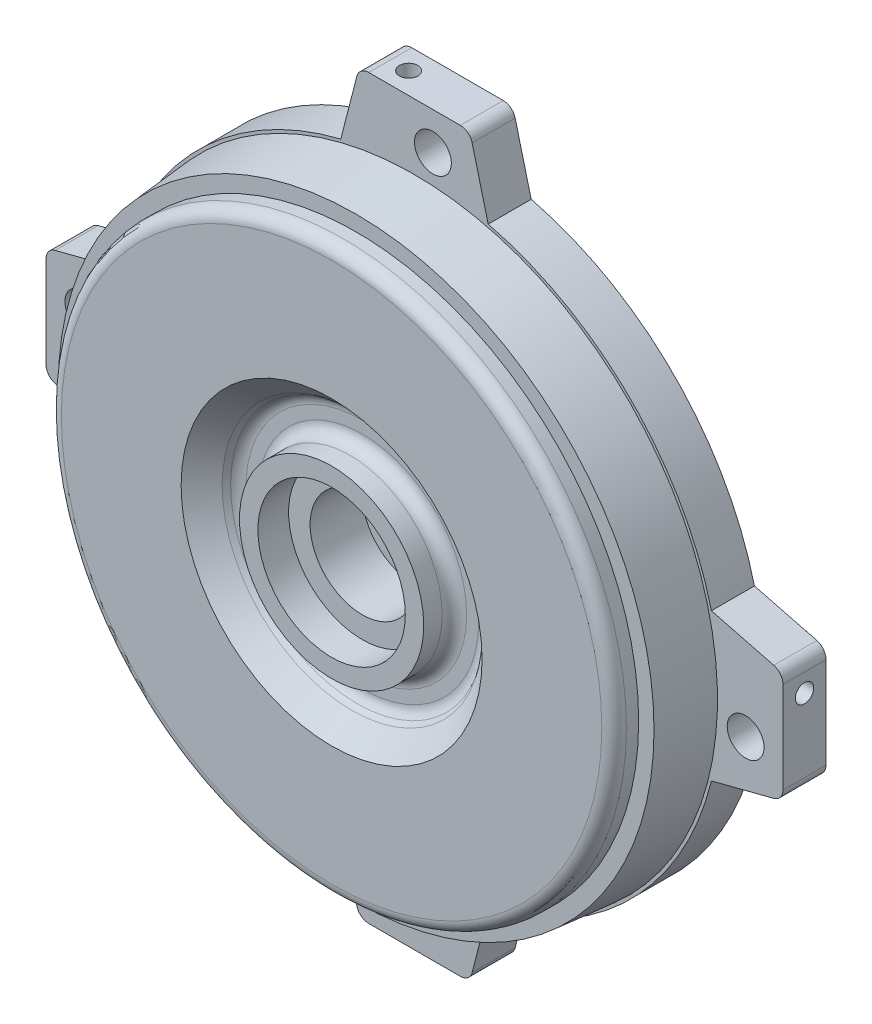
ISO-10303-21;
HEADER;
FILE_DESCRIPTION(('STEP AP214'),'2;1');
FILE_NAME('part.step','',(''),(''),'','','');
FILE_SCHEMA(('AUTOMOTIVE_DESIGN { 1 0 10303 214 1 1 1 1 }'));
ENDSEC;
DATA;
#1=APPLICATION_CONTEXT('core data for automotive mechanical design processes');
#2=APPLICATION_PROTOCOL_DEFINITION('international standard','automotive_design',2000,#1);
#3=PRODUCT_CONTEXT('',#1,'mechanical');
#4=PRODUCT('Part','Part','',(#3));
#5=PRODUCT_RELATED_PRODUCT_CATEGORY('part','',(#4));
#6=PRODUCT_DEFINITION_FORMATION('','',#4);
#7=PRODUCT_DEFINITION_CONTEXT('part definition',#1,'design');
#8=PRODUCT_DEFINITION('design','',#6,#7);
#9=PRODUCT_DEFINITION_SHAPE('','',#8);
#10=(LENGTH_UNIT() NAMED_UNIT(*) SI_UNIT(.MILLI.,.METRE.));
#11=(NAMED_UNIT(*) PLANE_ANGLE_UNIT() SI_UNIT($,.RADIAN.));
#12=(NAMED_UNIT(*) SI_UNIT($,.STERADIAN.) SOLID_ANGLE_UNIT());
#13=UNCERTAINTY_MEASURE_WITH_UNIT(LENGTH_MEASURE(1.E-05),#10,'distance_accuracy_value','');
#14=(GEOMETRIC_REPRESENTATION_CONTEXT(3) GLOBAL_UNCERTAINTY_ASSIGNED_CONTEXT((#13)) GLOBAL_UNIT_ASSIGNED_CONTEXT((#10,
#11,#12)) REPRESENTATION_CONTEXT('',''));
#15=CARTESIAN_POINT('',(0.,0.,0.));
#16=DIRECTION('',(0.,0.,1.));
#17=DIRECTION('',(1.,0.,0.));
#18=AXIS2_PLACEMENT_3D('',#15,#16,#17);
#19=CARTESIAN_POINT('',(0.,0.,-16.5));
#20=DIRECTION('',(0.,0.,1.));
#21=DIRECTION('',(1.,0.,0.));
#22=AXIS2_PLACEMENT_3D('',#19,#20,#21);
#23=CYLINDRICAL_SURFACE('',#22,8.5);
#24=CARTESIAN_POINT('',(0.,0.,-1.));
#25=DIRECTION('',(0.,0.,1.));
#26=DIRECTION('',(1.,0.,0.));
#27=AXIS2_PLACEMENT_3D('',#24,#25,#26);
#28=CIRCLE('',#27,8.5);
#29=CARTESIAN_POINT('',(8.5,0.,-1.));
#30=VERTEX_POINT('',#29);
#31=EDGE_CURVE('E561',#30,#30,#28,.T.);
#32=ORIENTED_EDGE('',*,*,#31,.T.);
#33=EDGE_LOOP('',(#32));
#34=FACE_BOUND('',#33,.T.);
#35=CARTESIAN_POINT('',(0.,0.,-9.5));
#36=DIRECTION('',(0.,0.,-1.));
#37=DIRECTION('',(-1.,0.,0.));
#38=AXIS2_PLACEMENT_3D('',#35,#36,#37);
#39=CIRCLE('',#38,8.5);
#40=CARTESIAN_POINT('',(-8.5,0.,-9.5));
#41=VERTEX_POINT('',#40);
#42=EDGE_CURVE('E254',#41,#41,#39,.F.);
#43=ORIENTED_EDGE('',*,*,#42,.F.);
#44=EDGE_LOOP('',(#43));
#45=FACE_BOUND('',#44,.T.);
#46=ADVANCED_FACE('F16',(#34,#45),#23,.F.);
#47=CARTESIAN_POINT('',(0.,0.,0.));
#48=DIRECTION('',(0.,0.,-1.));
#49=DIRECTION('',(-1.,0.,0.));
#50=AXIS2_PLACEMENT_3D('',#47,#48,#49);
#51=CONICAL_SURFACE('',#50,48.5,0.0872664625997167);
#52=CARTESIAN_POINT('',(0.,0.,0.));
#53=DIRECTION('',(0.,0.,-1.));
#54=DIRECTION('',(-1.,0.,0.));
#55=AXIS2_PLACEMENT_3D('',#52,#53,#54);
#56=CIRCLE('',#55,48.5);
#57=CARTESIAN_POINT('',(-48.5,0.,0.));
#58=VERTEX_POINT('',#57);
#59=EDGE_CURVE('E219',#58,#58,#56,.T.);
#60=ORIENTED_EDGE('',*,*,#59,.T.);
#61=EDGE_LOOP('',(#60));
#62=FACE_BOUND('',#61,.T.);
#63=CARTESIAN_POINT('',(0.,0.,-9.5));
#64=DIRECTION('',(0.,0.,-1.));
#65=DIRECTION('',(-1.,0.,0.));
#66=AXIS2_PLACEMENT_3D('',#63,#64,#65);
#67=CIRCLE('',#66,49.3311423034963);
#68=CARTESIAN_POINT('',(-49.3311423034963,0.,-9.5));
#69=VERTEX_POINT('',#68);
#70=EDGE_CURVE('E250',#69,#69,#67,.T.);
#71=ORIENTED_EDGE('',*,*,#70,.F.);
#72=EDGE_LOOP('',(#71));
#73=FACE_BOUND('',#72,.T.);
#74=ADVANCED_FACE('F387',(#62,#73),#51,.T.);
#75=CARTESIAN_POINT('',(0.,0.,-1.));
#76=DIRECTION('',(0.,0.,1.));
#77=DIRECTION('',(1.,0.,0.));
#78=AXIS2_PLACEMENT_3D('',#75,#76,#77);
#79=PLANE('',#78);
#80=CARTESIAN_POINT('',(0.,0.,-1.));
#81=DIRECTION('',(0.,0.,1.));
#82=DIRECTION('',(1.,0.,0.));
#83=AXIS2_PLACEMENT_3D('',#80,#81,#82);
#84=CIRCLE('',#83,17.);
#85=CARTESIAN_POINT('',(17.,0.,-1.));
#86=VERTEX_POINT('',#85);
#87=EDGE_CURVE('E242',#86,#86,#84,.F.);
#88=ORIENTED_EDGE('',*,*,#87,.T.);
#89=EDGE_LOOP('',(#88));
#90=FACE_BOUND('',#89,.T.);
#91=CARTESIAN_POINT('',(0.,0.,-1.));
#92=DIRECTION('',(0.,0.,1.));
#93=DIRECTION('',(1.,0.,0.));
#94=AXIS2_PLACEMENT_3D('',#91,#92,#93);
#95=CIRCLE('',#94,18.9578282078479);
#96=CARTESIAN_POINT('',(18.957828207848,0.,-1.));
#97=VERTEX_POINT('',#96);
#98=EDGE_CURVE('E238',#97,#97,#95,.T.);
#99=ORIENTED_EDGE('',*,*,#98,.T.);
#100=EDGE_LOOP('',(#99));
#101=FACE_BOUND('',#100,.T.);
#102=ADVANCED_FACE('F393',(#90,#101),#79,.T.);
#103=CARTESIAN_POINT('',(0.,0.,4.));
#104=DIRECTION('',(0.,0.,-1.));
#105=DIRECTION('',(-1.,0.,0.));
#106=AXIS2_PLACEMENT_3D('',#103,#104,#105);
#107=CYLINDRICAL_SURFACE('',#106,46.);
#108=CARTESIAN_POINT('',(0.,0.,2.));
#109=DIRECTION('',(0.,0.,1.));
#110=DIRECTION('',(1.,0.,0.));
#111=AXIS2_PLACEMENT_3D('',#108,#109,#110);
#112=CIRCLE('',#111,46.);
#113=CARTESIAN_POINT('',(46.,0.,2.));
#114=VERTEX_POINT('',#113);
#115=EDGE_CURVE('E259',#114,#114,#112,.F.);
#116=ORIENTED_EDGE('',*,*,#115,.T.);
#117=EDGE_LOOP('',(#116));
#118=FACE_BOUND('',#117,.T.);
#119=CARTESIAN_POINT('',(0.,0.,0.));
#120=DIRECTION('',(0.,0.,-1.));
#121=DIRECTION('',(-1.,0.,0.));
#122=AXIS2_PLACEMENT_3D('',#119,#120,#121);
#123=CIRCLE('',#122,46.);
#124=CARTESIAN_POINT('',(-46.,0.,0.));
#125=VERTEX_POINT('',#124);
#126=EDGE_CURVE('E230',#125,#125,#123,.T.);
#127=ORIENTED_EDGE('',*,*,#126,.F.);
#128=EDGE_LOOP('',(#127));
#129=FACE_BOUND('',#128,.T.);
#130=ADVANCED_FACE('F18',(#118,#129),#107,.T.);
#131=CARTESIAN_POINT('',(0.,0.,4.));
#132=DIRECTION('',(0.,0.,1.));
#133=DIRECTION('',(1.,0.,0.));
#134=AXIS2_PLACEMENT_3D('',#131,#132,#133);
#135=PLANE('',#134);
#136=CARTESIAN_POINT('',(0.,0.,4.));
#137=DIRECTION('',(0.,0.,1.));
#138=DIRECTION('',(1.,0.,0.));
#139=AXIS2_PLACEMENT_3D('',#136,#137,#138);
#140=CIRCLE('',#139,24.5);
#141=CARTESIAN_POINT('',(24.5,0.,4.));
#142=VERTEX_POINT('',#141);
#143=EDGE_CURVE('E11',#142,#142,#140,.F.);
#144=ORIENTED_EDGE('',*,*,#143,.T.);
#145=EDGE_LOOP('',(#144));
#146=FACE_BOUND('',#145,.T.);
#147=CARTESIAN_POINT('',(0.,0.,4.));
#148=DIRECTION('',(0.,0.,1.));
#149=DIRECTION('',(1.,0.,0.));
#150=AXIS2_PLACEMENT_3D('',#147,#148,#149);
#151=CIRCLE('',#150,44.);
#152=CARTESIAN_POINT('',(44.,0.,4.));
#153=VERTEX_POINT('',#152);
#154=EDGE_CURVE('E255',#153,#153,#151,.T.);
#155=ORIENTED_EDGE('',*,*,#154,.T.);
#156=EDGE_LOOP('',(#155));
#157=FACE_BOUND('',#156,.T.);
#158=ADVANCED_FACE('F434',(#146,#157),#135,.T.);
#159=CARTESIAN_POINT('',(0.,0.,0.));
#160=DIRECTION('',(0.,0.,-1.));
#161=DIRECTION('',(-1.,0.,0.));
#162=AXIS2_PLACEMENT_3D('',#159,#160,#161);
#163=PLANE('',#162);
#164=ORIENTED_EDGE('',*,*,#59,.F.);
#165=EDGE_LOOP('',(#164));
#166=FACE_BOUND('',#165,.T.);
#167=ORIENTED_EDGE('',*,*,#126,.T.);
#168=EDGE_LOOP('',(#167));
#169=FACE_BOUND('',#168,.T.);
#170=ADVANCED_FACE('F423',(#166,#169),#163,.F.);
#171=CARTESIAN_POINT('',(0.,0.,4.));
#172=DIRECTION('',(0.,0.,1.));
#173=DIRECTION('',(1.,0.,0.));
#174=AXIS2_PLACEMENT_3D('',#171,#172,#173);
#175=CONICAL_SURFACE('',#174,23.5,0.610865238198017);
#176=CARTESIAN_POINT('',(0.,0.,0.664359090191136));
#177=DIRECTION('',(0.,0.,1.));
#178=DIRECTION('',(1.,0.,0.));
#179=AXIS2_PLACEMENT_3D('',#176,#177,#178);
#180=CIRCLE('',#179,21.1643590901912);
#181=CARTESIAN_POINT('',(21.1643590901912,0.,0.664359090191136));
#182=VERTEX_POINT('',#181);
#183=EDGE_CURVE('E25',#182,#182,#180,.T.);
#184=ORIENTED_EDGE('',*,*,#183,.T.);
#185=EDGE_LOOP('',(#184));
#186=FACE_BOUND('',#185,.T.);
#187=CARTESIAN_POINT('',(0.,0.,-0.147152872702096));
#188=DIRECTION('',(0.,0.,-1.));
#189=DIRECTION('',(-1.,0.,0.));
#190=AXIS2_PLACEMENT_3D('',#187,#188,#189);
#191=CIRCLE('',#190,20.5961322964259);
#192=CARTESIAN_POINT('',(-20.596132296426,0.,-0.147152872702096));
#193=VERTEX_POINT('',#192);
#194=EDGE_CURVE('E246',#193,#193,#191,.T.);
#195=ORIENTED_EDGE('',*,*,#194,.T.);
#196=EDGE_LOOP('',(#195));
#197=FACE_BOUND('',#196,.T.);
#198=ADVANCED_FACE('F365',(#186,#197),#175,.F.);
#199=CARTESIAN_POINT('',(0.,0.,46.4264068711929));
#200=DIRECTION('',(0.,0.,-1.));
#201=DIRECTION('',(-1.,0.,0.));
#202=AXIS2_PLACEMENT_3D('',#199,#200,#201);
#203=CYLINDRICAL_SURFACE('',#202,15.);
#204=CARTESIAN_POINT('',(0.,0.,1.));
#205=DIRECTION('',(0.,0.,1.));
#206=DIRECTION('',(1.,0.,0.));
#207=AXIS2_PLACEMENT_3D('',#204,#205,#206);
#208=CIRCLE('',#207,15.);
#209=CARTESIAN_POINT('',(15.,0.,1.));
#210=VERTEX_POINT('',#209);
#211=EDGE_CURVE('E234',#210,#210,#208,.T.);
#212=ORIENTED_EDGE('',*,*,#211,.T.);
#213=EDGE_LOOP('',(#212));
#214=FACE_BOUND('',#213,.T.);
#215=CARTESIAN_POINT('',(0.,0.,4.));
#216=DIRECTION('',(0.,0.,1.));
#217=DIRECTION('',(1.,0.,0.));
#218=AXIS2_PLACEMENT_3D('',#215,#216,#217);
#219=CIRCLE('',#218,15.);
#220=CARTESIAN_POINT('',(15.,0.,4.));
#221=VERTEX_POINT('',#220);
#222=EDGE_CURVE('E225',#221,#221,#219,.T.);
#223=ORIENTED_EDGE('',*,*,#222,.F.);
#224=EDGE_LOOP('',(#223));
#225=FACE_BOUND('',#224,.T.);
#226=ADVANCED_FACE('F411',(#214,#225),#203,.T.);
#227=CARTESIAN_POINT('',(0.,0.,4.));
#228=DIRECTION('',(0.,0.,1.));
#229=DIRECTION('',(1.,0.,0.));
#230=AXIS2_PLACEMENT_3D('',#227,#228,#229);
#231=PLANE('',#230);
#232=CARTESIAN_POINT('',(0.,0.,4.));
#233=DIRECTION('',(0.,0.,1.));
#234=DIRECTION('',(1.,0.,0.));
#235=AXIS2_PLACEMENT_3D('',#232,#233,#234);
#236=CIRCLE('',#235,12.);
#237=CARTESIAN_POINT('',(12.,0.,4.));
#238=VERTEX_POINT('',#237);
#239=EDGE_CURVE('E555',#238,#238,#236,.T.);
#240=ORIENTED_EDGE('',*,*,#239,.F.);
#241=EDGE_LOOP('',(#240));
#242=FACE_BOUND('',#241,.T.);
#243=ORIENTED_EDGE('',*,*,#222,.T.);
#244=EDGE_LOOP('',(#243));
#245=FACE_BOUND('',#244,.T.);
#246=ADVANCED_FACE('F409',(#242,#245),#231,.T.);
#247=CARTESIAN_POINT('',(0.,0.,-1.));
#248=DIRECTION('',(0.,0.,1.));
#249=DIRECTION('',(1.,0.,0.));
#250=AXIS2_PLACEMENT_3D('',#247,#248,#249);
#251=CYLINDRICAL_SURFACE('',#250,12.);
#252=CARTESIAN_POINT('',(0.,0.,-1.));
#253=DIRECTION('',(0.,0.,1.));
#254=DIRECTION('',(1.,0.,0.));
#255=AXIS2_PLACEMENT_3D('',#252,#253,#254);
#256=CIRCLE('',#255,12.);
#257=CARTESIAN_POINT('',(12.,0.,-1.));
#258=VERTEX_POINT('',#257);
#259=EDGE_CURVE('E548',#258,#258,#256,.T.);
#260=ORIENTED_EDGE('',*,*,#259,.F.);
#261=EDGE_LOOP('',(#260));
#262=FACE_BOUND('',#261,.T.);
#263=ORIENTED_EDGE('',*,*,#239,.T.);
#264=EDGE_LOOP('',(#263));
#265=FACE_BOUND('',#264,.T.);
#266=ADVANCED_FACE('F405',(#262,#265),#251,.F.);
#267=CARTESIAN_POINT('',(0.,0.,-1.));
#268=DIRECTION('',(0.,0.,1.));
#269=DIRECTION('',(1.,0.,0.));
#270=AXIS2_PLACEMENT_3D('',#267,#268,#269);
#271=PLANE('',#270);
#272=ORIENTED_EDGE('',*,*,#31,.F.);
#273=EDGE_LOOP('',(#272));
#274=FACE_BOUND('',#273,.T.);
#275=ORIENTED_EDGE('',*,*,#259,.T.);
#276=EDGE_LOOP('',(#275));
#277=FACE_BOUND('',#276,.T.);
#278=ADVANCED_FACE('F402',(#274,#277),#271,.T.);
#279=CARTESIAN_POINT('',(0.,0.,1.));
#280=DIRECTION('',(0.,0.,1.));
#281=DIRECTION('',(1.,0.,0.));
#282=AXIS2_PLACEMENT_3D('',#279,#280,#281);
#283=TOROIDAL_SURFACE('',#282,17.,2.);
#284=ORIENTED_EDGE('',*,*,#87,.F.);
#285=EDGE_LOOP('',(#284));
#286=FACE_BOUND('',#285,.T.);
#287=ORIENTED_EDGE('',*,*,#211,.F.);
#288=EDGE_LOOP('',(#287));
#289=FACE_BOUND('',#288,.T.);
#290=ADVANCED_FACE('F400',(#286,#289),#283,.F.);
#291=CARTESIAN_POINT('',(0.,0.,1.));
#292=DIRECTION('',(0.,0.,1.));
#293=DIRECTION('',(1.,0.,0.));
#294=AXIS2_PLACEMENT_3D('',#291,#292,#293);
#295=TOROIDAL_SURFACE('',#294,18.9578282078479,2.);
#296=ORIENTED_EDGE('',*,*,#194,.F.);
#297=EDGE_LOOP('',(#296));
#298=FACE_BOUND('',#297,.T.);
#299=ORIENTED_EDGE('',*,*,#98,.F.);
#300=EDGE_LOOP('',(#299));
#301=FACE_BOUND('',#300,.T.);
#302=ADVANCED_FACE('F466',(#298,#301),#295,.F.);
#303=CARTESIAN_POINT('',(53.9166022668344,-3.,-9.49999999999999));
#304=DIRECTION('',(0.,0.,-1.));
#305=DIRECTION('',(-1.,0.,0.));
#306=AXIS2_PLACEMENT_3D('',#303,#304,#305);
#307=CYLINDRICAL_SURFACE('',#306,3.);
#308=CARTESIAN_POINT('',(53.9166022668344,-3.,-9.49999999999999));
#309=DIRECTION('',(0.,0.,-1.));
#310=DIRECTION('',(-1.,0.,0.));
#311=AXIS2_PLACEMENT_3D('',#308,#309,#310);
#312=CIRCLE('',#311,3.);
#313=CARTESIAN_POINT('',(50.9166022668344,-3.,-9.49999999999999));
#314=VERTEX_POINT('',#313);
#315=EDGE_CURVE('E703',#314,#314,#312,.T.);
#316=ORIENTED_EDGE('',*,*,#315,.F.);
#317=EDGE_LOOP('',(#316));
#318=FACE_BOUND('',#317,.T.);
#319=CARTESIAN_POINT('',(53.9166022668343,-3.,-16.5));
#320=DIRECTION('',(0.,0.,-1.));
#321=DIRECTION('',(-1.,0.,0.));
#322=AXIS2_PLACEMENT_3D('',#319,#320,#321);
#323=CIRCLE('',#322,3.);
#324=CARTESIAN_POINT('',(50.9166022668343,-3.,-16.5));
#325=VERTEX_POINT('',#324);
#326=EDGE_CURVE('E707',#325,#325,#323,.T.);
#327=ORIENTED_EDGE('',*,*,#326,.T.);
#328=EDGE_LOOP('',(#327));
#329=FACE_BOUND('',#328,.T.);
#330=ADVANCED_FACE('F462',(#318,#329),#307,.F.);
#331=CARTESIAN_POINT('',(-3.,-53.9166022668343,-9.5));
#332=DIRECTION('',(0.,0.,-1.));
#333=DIRECTION('',(-1.,0.,0.));
#334=AXIS2_PLACEMENT_3D('',#331,#332,#333);
#335=CYLINDRICAL_SURFACE('',#334,3.);
#336=CARTESIAN_POINT('',(-3.,-53.9166022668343,-9.5));
#337=DIRECTION('',(0.,0.,-1.));
#338=DIRECTION('',(-1.,0.,0.));
#339=AXIS2_PLACEMENT_3D('',#336,#337,#338);
#340=CIRCLE('',#339,3.);
#341=CARTESIAN_POINT('',(-6.,-53.9166022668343,-9.5));
#342=VERTEX_POINT('',#341);
#343=EDGE_CURVE('E695',#342,#342,#340,.T.);
#344=ORIENTED_EDGE('',*,*,#343,.F.);
#345=EDGE_LOOP('',(#344));
#346=FACE_BOUND('',#345,.T.);
#347=CARTESIAN_POINT('',(-3.,-53.9166022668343,-16.5));
#348=DIRECTION('',(0.,0.,-1.));
#349=DIRECTION('',(-1.,0.,0.));
#350=AXIS2_PLACEMENT_3D('',#347,#348,#349);
#351=CIRCLE('',#350,3.);
#352=CARTESIAN_POINT('',(-6.,-53.9166022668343,-16.5));
#353=VERTEX_POINT('',#352);
#354=EDGE_CURVE('E699',#353,#353,#351,.T.);
#355=ORIENTED_EDGE('',*,*,#354,.T.);
#356=EDGE_LOOP('',(#355));
#357=FACE_BOUND('',#356,.T.);
#358=ADVANCED_FACE('F465',(#346,#357),#335,.F.);
#359=CARTESIAN_POINT('',(-53.9166022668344,3.00000000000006,-9.5));
#360=DIRECTION('',(0.,0.,-1.));
#361=DIRECTION('',(-1.,0.,0.));
#362=AXIS2_PLACEMENT_3D('',#359,#360,#361);
#363=CYLINDRICAL_SURFACE('',#362,3.);
#364=CARTESIAN_POINT('',(-53.9166022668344,3.00000000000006,-9.5));
#365=DIRECTION('',(0.,0.,-1.));
#366=DIRECTION('',(-1.,0.,0.));
#367=AXIS2_PLACEMENT_3D('',#364,#365,#366);
#368=CIRCLE('',#367,3.);
#369=CARTESIAN_POINT('',(-56.9166022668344,3.00000000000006,-9.5));
#370=VERTEX_POINT('',#369);
#371=EDGE_CURVE('E687',#370,#370,#368,.T.);
#372=ORIENTED_EDGE('',*,*,#371,.F.);
#373=EDGE_LOOP('',(#372));
#374=FACE_BOUND('',#373,.T.);
#375=CARTESIAN_POINT('',(-53.9166022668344,3.00000000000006,-16.5));
#376=DIRECTION('',(0.,0.,-1.));
#377=DIRECTION('',(-1.,0.,0.));
#378=AXIS2_PLACEMENT_3D('',#375,#376,#377);
#379=CIRCLE('',#378,3.);
#380=CARTESIAN_POINT('',(-56.9166022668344,3.00000000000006,-16.5));
#381=VERTEX_POINT('',#380);
#382=EDGE_CURVE('E691',#381,#381,#379,.T.);
#383=ORIENTED_EDGE('',*,*,#382,.T.);
#384=EDGE_LOOP('',(#383));
#385=FACE_BOUND('',#384,.T.);
#386=ADVANCED_FACE('F470',(#374,#385),#363,.F.);
#387=CARTESIAN_POINT('',(3.,53.9166022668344,-9.5));
#388=DIRECTION('',(0.,0.,-1.));
#389=DIRECTION('',(-1.,0.,0.));
#390=AXIS2_PLACEMENT_3D('',#387,#388,#389);
#391=CYLINDRICAL_SURFACE('',#390,3.);
#392=CARTESIAN_POINT('',(3.,53.9166022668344,-9.5));
#393=DIRECTION('',(0.,0.,-1.));
#394=DIRECTION('',(-1.,0.,0.));
#395=AXIS2_PLACEMENT_3D('',#392,#393,#394);
#396=CIRCLE('',#395,3.);
#397=CARTESIAN_POINT('',(0.,53.9166022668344,-9.5));
#398=VERTEX_POINT('',#397);
#399=EDGE_CURVE('E202',#398,#398,#396,.T.);
#400=ORIENTED_EDGE('',*,*,#399,.F.);
#401=EDGE_LOOP('',(#400));
#402=FACE_BOUND('',#401,.T.);
#403=CARTESIAN_POINT('',(3.,53.9166022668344,-16.5));
#404=DIRECTION('',(0.,0.,-1.));
#405=DIRECTION('',(-1.,0.,0.));
#406=AXIS2_PLACEMENT_3D('',#403,#404,#405);
#407=CIRCLE('',#406,3.);
#408=CARTESIAN_POINT('',(0.,53.9166022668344,-16.5));
#409=VERTEX_POINT('',#408);
#410=EDGE_CURVE('E684',#409,#409,#407,.T.);
#411=ORIENTED_EDGE('',*,*,#410,.T.);
#412=EDGE_LOOP('',(#411));
#413=FACE_BOUND('',#412,.T.);
#414=ADVANCED_FACE('F474',(#402,#413),#391,.F.);
#415=CARTESIAN_POINT('',(48.3453018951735,12.0000000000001,-9.5));
#416=DIRECTION('',(0.249280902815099,0.968431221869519,0.));
#417=DIRECTION('',(-0.968431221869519,0.249280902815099,0.));
#418=AXIS2_PLACEMENT_3D('',#415,#416,#417);
#419=PLANE('',#418);
#420=DIRECTION('',(0.968431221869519,-0.249280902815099,0.));
#421=VECTOR('',#420,1.);
#422=CARTESIAN_POINT('',(48.3453018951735,12.0000000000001,-9.5));
#423=LINE('',#422,#421);
#424=CARTESIAN_POINT('',(48.3453018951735,12.0000000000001,-9.5));
#425=VERTEX_POINT('',#424);
#426=CARTESIAN_POINT('',(58.4985618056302,9.38648058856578,-9.5));
#427=VERTEX_POINT('',#426);
#428=EDGE_CURVE('E641',#425,#427,#423,.T.);
#429=ORIENTED_EDGE('',*,*,#428,.T.);
#430=DIRECTION('',(0.,0.,-1.));
#431=VECTOR('',#430,1.);
#432=CARTESIAN_POINT('',(58.4985618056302,9.38648058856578,-9.5));
#433=LINE('',#432,#431);
#434=CARTESIAN_POINT('',(58.4985618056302,9.38648058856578,-16.5));
#435=VERTEX_POINT('',#434);
#436=EDGE_CURVE('E198',#427,#435,#433,.T.);
#437=ORIENTED_EDGE('',*,*,#436,.T.);
#438=DIRECTION('',(0.968431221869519,-0.249280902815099,0.));
#439=VECTOR('',#438,1.);
#440=CARTESIAN_POINT('',(48.3453018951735,12.0000000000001,-16.5));
#441=LINE('',#440,#439);
#442=CARTESIAN_POINT('',(48.3453018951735,12.0000000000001,-16.5));
#443=VERTEX_POINT('',#442);
#444=EDGE_CURVE('E195',#443,#435,#441,.T.);
#445=ORIENTED_EDGE('',*,*,#444,.F.);
#446=DIRECTION('',(0.,0.,-1.));
#447=VECTOR('',#446,1.);
#448=CARTESIAN_POINT('',(48.3453018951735,12.0000000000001,-9.5));
#449=LINE('',#448,#447);
#450=EDGE_CURVE('E180',#425,#443,#449,.T.);
#451=ORIENTED_EDGE('',*,*,#450,.F.);
#452=EDGE_LOOP('',(#429,#437,#445,#451));
#453=FACE_BOUND('',#452,.T.);
#454=ADVANCED_FACE('F196',(#453),#419,.T.);
#455=CARTESIAN_POINT('',(60.0000000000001,9.00000000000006,-9.5));
#456=DIRECTION('',(1.,0.,0.));
#457=DIRECTION('',(0.,0.,-1.));
#458=AXIS2_PLACEMENT_3D('',#455,#456,#457);
#459=PLANE('',#458);
#460=CARTESIAN_POINT('',(60.0000000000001,4.44961814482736,-13.));
#461=DIRECTION('',(1.,0.,0.));
#462=DIRECTION('',(0.,0.,1.));
#463=AXIS2_PLACEMENT_3D('',#460,#461,#462);
#464=CIRCLE('',#463,1.5);
#465=CARTESIAN_POINT('',(60.0000000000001,4.44961814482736,-11.5));
#466=VERTEX_POINT('',#465);
#467=EDGE_CURVE('E747',#466,#466,#464,.T.);
#468=ORIENTED_EDGE('',*,*,#467,.F.);
#469=EDGE_LOOP('',(#468));
#470=FACE_BOUND('',#469,.T.);
#471=DIRECTION('',(0.,-1.,0.));
#472=VECTOR('',#471,1.);
#473=CARTESIAN_POINT('',(60.0000000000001,9.00000000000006,-16.5));
#474=LINE('',#473,#472);
#475=CARTESIAN_POINT('',(60.0000000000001,7.44961814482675,-16.5));
#476=VERTEX_POINT('',#475);
#477=CARTESIAN_POINT('',(60.0000000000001,-7.4496181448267,-16.5));
#478=VERTEX_POINT('',#477);
#479=EDGE_CURVE('E201',#476,#478,#474,.T.);
#480=ORIENTED_EDGE('',*,*,#479,.F.);
#481=DIRECTION('',(0.,0.,-1.));
#482=VECTOR('',#481,1.);
#483=CARTESIAN_POINT('',(60.0000000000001,7.44961814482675,-9.5));
#484=LINE('',#483,#482);
#485=CARTESIAN_POINT('',(60.0000000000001,7.44961814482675,-9.5));
#486=VERTEX_POINT('',#485);
#487=EDGE_CURVE('E327',#476,#486,#484,.F.);
#488=ORIENTED_EDGE('',*,*,#487,.T.);
#489=DIRECTION('',(0.,-1.,0.));
#490=VECTOR('',#489,1.);
#491=CARTESIAN_POINT('',(60.0000000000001,9.00000000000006,-9.5));
#492=LINE('',#491,#490);
#493=CARTESIAN_POINT('',(60.0000000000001,-7.4496181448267,-9.5));
#494=VERTEX_POINT('',#493);
#495=EDGE_CURVE('E638',#486,#494,#492,.T.);
#496=ORIENTED_EDGE('',*,*,#495,.T.);
#497=DIRECTION('',(0.,0.,-1.));
#498=VECTOR('',#497,1.);
#499=CARTESIAN_POINT('',(60.0000000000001,-7.4496181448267,-9.5));
#500=LINE('',#499,#498);
#501=EDGE_CURVE('E323',#494,#478,#500,.T.);
#502=ORIENTED_EDGE('',*,*,#501,.T.);
#503=EDGE_LOOP('',(#480,#488,#496,#502));
#504=FACE_BOUND('',#503,.T.);
#505=ADVANCED_FACE('F522',(#470,#504),#459,.T.);
#506=CARTESIAN_POINT('',(60.0000000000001,-9.00000000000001,-9.5));
#507=DIRECTION('',(0.249280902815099,-0.968431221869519,0.));
#508=DIRECTION('',(0.968431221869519,0.249280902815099,0.));
#509=AXIS2_PLACEMENT_3D('',#506,#507,#508);
#510=PLANE('',#509);
#511=DIRECTION('',(-0.968431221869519,-0.249280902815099,0.));
#512=VECTOR('',#511,1.);
#513=CARTESIAN_POINT('',(60.0000000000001,-9.00000000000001,-16.5));
#514=LINE('',#513,#512);
#515=CARTESIAN_POINT('',(58.4985618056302,-9.38648058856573,-16.5));
#516=VERTEX_POINT('',#515);
#517=CARTESIAN_POINT('',(48.3453018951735,-12.,-16.5));
#518=VERTEX_POINT('',#517);
#519=EDGE_CURVE('E675',#516,#518,#514,.T.);
#520=ORIENTED_EDGE('',*,*,#519,.F.);
#521=DIRECTION('',(0.,0.,-1.));
#522=VECTOR('',#521,1.);
#523=CARTESIAN_POINT('',(58.4985618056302,-9.38648058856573,-9.5));
#524=LINE('',#523,#522);
#525=CARTESIAN_POINT('',(58.4985618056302,-9.38648058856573,-9.5));
#526=VERTEX_POINT('',#525);
#527=EDGE_CURVE('E330',#516,#526,#524,.F.);
#528=ORIENTED_EDGE('',*,*,#527,.T.);
#529=DIRECTION('',(-0.968431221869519,-0.249280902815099,0.));
#530=VECTOR('',#529,1.);
#531=CARTESIAN_POINT('',(60.0000000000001,-9.00000000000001,-9.5));
#532=LINE('',#531,#530);
#533=CARTESIAN_POINT('',(48.3453018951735,-12.,-9.5));
#534=VERTEX_POINT('',#533);
#535=EDGE_CURVE('E635',#526,#534,#532,.T.);
#536=ORIENTED_EDGE('',*,*,#535,.T.);
#537=DIRECTION('',(0.,0.,-1.));
#538=VECTOR('',#537,1.);
#539=CARTESIAN_POINT('',(48.3453018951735,-12.,-9.5));
#540=LINE('',#539,#538);
#541=EDGE_CURVE('E190',#534,#518,#540,.T.);
#542=ORIENTED_EDGE('',*,*,#541,.T.);
#543=EDGE_LOOP('',(#520,#528,#536,#542));
#544=FACE_BOUND('',#543,.T.);
#545=ADVANCED_FACE('F518',(#544),#510,.T.);
#546=CARTESIAN_POINT('',(9.00000000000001,-60.,-9.5));
#547=DIRECTION('',(0.968431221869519,-0.249280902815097,0.));
#548=DIRECTION('',(0.249280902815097,0.968431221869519,0.));
#549=AXIS2_PLACEMENT_3D('',#546,#547,#548);
#550=PLANE('',#549);
#551=DIRECTION('',(-0.249280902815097,-0.968431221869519,0.));
#552=VECTOR('',#551,1.);
#553=CARTESIAN_POINT('',(9.00000000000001,-60.,-9.5));
#554=LINE('',#553,#552);
#555=CARTESIAN_POINT('',(12.,-48.3453018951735,-9.5));
#556=VERTEX_POINT('',#555);
#557=CARTESIAN_POINT('',(9.38648058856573,-58.4985618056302,-9.5));
#558=VERTEX_POINT('',#557);
#559=EDGE_CURVE('E627',#556,#558,#554,.T.);
#560=ORIENTED_EDGE('',*,*,#559,.T.);
#561=DIRECTION('',(0.,0.,-1.));
#562=VECTOR('',#561,1.);
#563=CARTESIAN_POINT('',(9.38648058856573,-58.4985618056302,-9.5));
#564=LINE('',#563,#562);
#565=CARTESIAN_POINT('',(9.38648058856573,-58.4985618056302,-16.5));
#566=VERTEX_POINT('',#565);
#567=EDGE_CURVE('E333',#558,#566,#564,.T.);
#568=ORIENTED_EDGE('',*,*,#567,.T.);
#569=DIRECTION('',(-0.249280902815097,-0.968431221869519,0.));
#570=VECTOR('',#569,1.);
#571=CARTESIAN_POINT('',(9.00000000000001,-60.,-16.5));
#572=LINE('',#571,#570);
#573=CARTESIAN_POINT('',(12.,-48.3453018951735,-16.5));
#574=VERTEX_POINT('',#573);
#575=EDGE_CURVE('E672',#574,#566,#572,.T.);
#576=ORIENTED_EDGE('',*,*,#575,.F.);
#577=DIRECTION('',(0.,0.,-1.));
#578=VECTOR('',#577,1.);
#579=CARTESIAN_POINT('',(12.,-48.3453018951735,-9.5));
#580=LINE('',#579,#578);
#581=EDGE_CURVE('E573',#556,#574,#580,.T.);
#582=ORIENTED_EDGE('',*,*,#581,.F.);
#583=EDGE_LOOP('',(#560,#568,#576,#582));
#584=FACE_BOUND('',#583,.T.);
#585=ADVANCED_FACE('F514',(#584),#550,.T.);
#586=CARTESIAN_POINT('',(-9.00000000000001,-60.,-9.5));
#587=DIRECTION('',(0.,-1.,0.));
#588=DIRECTION('',(0.,0.,-1.));
#589=AXIS2_PLACEMENT_3D('',#586,#587,#588);
#590=PLANE('',#589);
#591=CARTESIAN_POINT('',(4.44961814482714,-60.,-13.));
#592=DIRECTION('',(0.,-1.,0.));
#593=DIRECTION('',(0.,0.,1.));
#594=AXIS2_PLACEMENT_3D('',#591,#592,#593);
#595=CIRCLE('',#594,1.5);
#596=CARTESIAN_POINT('',(4.44961814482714,-60.,-11.5));
#597=VERTEX_POINT('',#596);
#598=EDGE_CURVE('E739',#597,#597,#595,.T.);
#599=ORIENTED_EDGE('',*,*,#598,.F.);
#600=EDGE_LOOP('',(#599));
#601=FACE_BOUND('',#600,.T.);
#602=DIRECTION('',(-1.,0.,0.));
#603=VECTOR('',#602,1.);
#604=CARTESIAN_POINT('',(-9.00000000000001,-60.,-16.5));
#605=LINE('',#604,#603);
#606=CARTESIAN_POINT('',(7.4496181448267,-60.,-16.5));
#607=VERTEX_POINT('',#606);
#608=CARTESIAN_POINT('',(-7.4496181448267,-60.,-16.5));
#609=VERTEX_POINT('',#608);
#610=EDGE_CURVE('E668',#607,#609,#605,.T.);
#611=ORIENTED_EDGE('',*,*,#610,.F.);
#612=DIRECTION('',(0.,0.,-1.));
#613=VECTOR('',#612,1.);
#614=CARTESIAN_POINT('',(7.4496181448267,-60.,-9.5));
#615=LINE('',#614,#613);
#616=CARTESIAN_POINT('',(7.4496181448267,-60.,-9.5));
#617=VERTEX_POINT('',#616);
#618=EDGE_CURVE('E341',#607,#617,#615,.F.);
#619=ORIENTED_EDGE('',*,*,#618,.T.);
#620=DIRECTION('',(-1.,0.,0.));
#621=VECTOR('',#620,1.);
#622=CARTESIAN_POINT('',(-9.00000000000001,-60.,-9.5));
#623=LINE('',#622,#621);
#624=CARTESIAN_POINT('',(-7.4496181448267,-60.,-9.5));
#625=VERTEX_POINT('',#624);
#626=EDGE_CURVE('E623',#617,#625,#623,.T.);
#627=ORIENTED_EDGE('',*,*,#626,.T.);
#628=DIRECTION('',(0.,0.,-1.));
#629=VECTOR('',#628,1.);
#630=CARTESIAN_POINT('',(-7.4496181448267,-60.,-9.5));
#631=LINE('',#630,#629);
#632=EDGE_CURVE('E337',#625,#609,#631,.T.);
#633=ORIENTED_EDGE('',*,*,#632,.T.);
#634=EDGE_LOOP('',(#611,#619,#627,#633));
#635=FACE_BOUND('',#634,.T.);
#636=ADVANCED_FACE('F510',(#601,#635),#590,.T.);
#637=CARTESIAN_POINT('',(-12.,-48.3453018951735,-9.5));
#638=DIRECTION('',(-0.968431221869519,-0.249280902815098,0.));
#639=DIRECTION('',(0.249280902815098,-0.968431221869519,0.));
#640=AXIS2_PLACEMENT_3D('',#637,#638,#639);
#641=PLANE('',#640);
#642=DIRECTION('',(-0.249280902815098,0.968431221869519,0.));
#643=VECTOR('',#642,1.);
#644=CARTESIAN_POINT('',(-12.,-48.3453018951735,-16.5));
#645=LINE('',#644,#643);
#646=CARTESIAN_POINT('',(-9.38648058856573,-58.4985618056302,-16.5));
#647=VERTEX_POINT('',#646);
#648=CARTESIAN_POINT('',(-12.,-48.3453018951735,-16.5));
#649=VERTEX_POINT('',#648);
#650=EDGE_CURVE('E665',#647,#649,#645,.T.);
#651=ORIENTED_EDGE('',*,*,#650,.F.);
#652=DIRECTION('',(0.,0.,-1.));
#653=VECTOR('',#652,1.);
#654=CARTESIAN_POINT('',(-9.38648058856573,-58.4985618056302,-9.5));
#655=LINE('',#654,#653);
#656=CARTESIAN_POINT('',(-9.38648058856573,-58.4985618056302,-9.5));
#657=VERTEX_POINT('',#656);
#658=EDGE_CURVE('E358',#647,#657,#655,.F.);
#659=ORIENTED_EDGE('',*,*,#658,.T.);
#660=DIRECTION('',(-0.249280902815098,0.968431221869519,0.));
#661=VECTOR('',#660,1.);
#662=CARTESIAN_POINT('',(-12.,-48.3453018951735,-9.5));
#663=LINE('',#662,#661);
#664=CARTESIAN_POINT('',(-12.,-48.3453018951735,-9.5));
#665=VERTEX_POINT('',#664);
#666=EDGE_CURVE('E620',#657,#665,#663,.T.);
#667=ORIENTED_EDGE('',*,*,#666,.T.);
#668=DIRECTION('',(0.,0.,-1.));
#669=VECTOR('',#668,1.);
#670=CARTESIAN_POINT('',(-12.,-48.3453018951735,-9.5));
#671=LINE('',#670,#669);
#672=EDGE_CURVE('E576',#665,#649,#671,.T.);
#673=ORIENTED_EDGE('',*,*,#672,.T.);
#674=EDGE_LOOP('',(#651,#659,#667,#673));
#675=FACE_BOUND('',#674,.T.);
#676=ADVANCED_FACE('F506',(#675),#641,.T.);
#677=CARTESIAN_POINT('',(-60.0000000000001,-9.00000000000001,-9.5));
#678=DIRECTION('',(-0.249280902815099,-0.968431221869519,0.));
#679=DIRECTION('',(0.968431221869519,-0.249280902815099,0.));
#680=AXIS2_PLACEMENT_3D('',#677,#678,#679);
#681=PLANE('',#680);
#682=DIRECTION('',(-0.968431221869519,0.249280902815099,0.));
#683=VECTOR('',#682,1.);
#684=CARTESIAN_POINT('',(-60.0000000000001,-9.00000000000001,-9.5));
#685=LINE('',#684,#683);
#686=CARTESIAN_POINT('',(-48.3453018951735,-12.,-9.5));
#687=VERTEX_POINT('',#686);
#688=CARTESIAN_POINT('',(-58.4985618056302,-9.38648058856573,-9.5));
#689=VERTEX_POINT('',#688);
#690=EDGE_CURVE('E613',#687,#689,#685,.T.);
#691=ORIENTED_EDGE('',*,*,#690,.T.);
#692=DIRECTION('',(0.,0.,-1.));
#693=VECTOR('',#692,1.);
#694=CARTESIAN_POINT('',(-58.4985618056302,-9.38648058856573,-9.5));
#695=LINE('',#694,#693);
#696=CARTESIAN_POINT('',(-58.4985618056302,-9.38648058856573,-16.5));
#697=VERTEX_POINT('',#696);
#698=EDGE_CURVE('E354',#689,#697,#695,.T.);
#699=ORIENTED_EDGE('',*,*,#698,.T.);
#700=DIRECTION('',(-0.968431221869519,0.249280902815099,0.));
#701=VECTOR('',#700,1.);
#702=CARTESIAN_POINT('',(-60.0000000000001,-9.00000000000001,-16.5));
#703=LINE('',#702,#701);
#704=CARTESIAN_POINT('',(-48.3453018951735,-12.,-16.5));
#705=VERTEX_POINT('',#704);
#706=EDGE_CURVE('E661',#705,#697,#703,.T.);
#707=ORIENTED_EDGE('',*,*,#706,.F.);
#708=DIRECTION('',(0.,0.,-1.));
#709=VECTOR('',#708,1.);
#710=CARTESIAN_POINT('',(-48.3453018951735,-12.,-9.5));
#711=LINE('',#710,#709);
#712=EDGE_CURVE('E580',#687,#705,#711,.T.);
#713=ORIENTED_EDGE('',*,*,#712,.F.);
#714=EDGE_LOOP('',(#691,#699,#707,#713));
#715=FACE_BOUND('',#714,.T.);
#716=ADVANCED_FACE('F502',(#715),#681,.T.);
#717=CARTESIAN_POINT('',(-60.0000000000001,9.00000000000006,-9.5));
#718=DIRECTION('',(-1.,0.,0.));
#719=DIRECTION('',(0.,0.,1.));
#720=AXIS2_PLACEMENT_3D('',#717,#718,#719);
#721=PLANE('',#720);
#722=CARTESIAN_POINT('',(-60.0000000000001,-4.44961814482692,-13.));
#723=DIRECTION('',(-1.,0.,0.));
#724=DIRECTION('',(0.,0.,1.));
#725=AXIS2_PLACEMENT_3D('',#722,#723,#724);
#726=CIRCLE('',#725,1.5);
#727=CARTESIAN_POINT('',(-60.0000000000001,-4.44961814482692,-11.5));
#728=VERTEX_POINT('',#727);
#729=EDGE_CURVE('E731',#728,#728,#726,.T.);
#730=ORIENTED_EDGE('',*,*,#729,.F.);
#731=EDGE_LOOP('',(#730));
#732=FACE_BOUND('',#731,.T.);
#733=DIRECTION('',(0.,1.,0.));
#734=VECTOR('',#733,1.);
#735=CARTESIAN_POINT('',(-60.0000000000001,9.00000000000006,-9.5));
#736=LINE('',#735,#734);
#737=CARTESIAN_POINT('',(-60.0000000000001,-7.4496181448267,-9.5));
#738=VERTEX_POINT('',#737);
#739=CARTESIAN_POINT('',(-60.0000000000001,7.44961814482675,-9.5));
#740=VERTEX_POINT('',#739);
#741=EDGE_CURVE('E609',#738,#740,#736,.T.);
#742=ORIENTED_EDGE('',*,*,#741,.T.);
#743=DIRECTION('',(0.,0.,-1.));
#744=VECTOR('',#743,1.);
#745=CARTESIAN_POINT('',(-60.0000000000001,7.44961814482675,-9.5));
#746=LINE('',#745,#744);
#747=CARTESIAN_POINT('',(-60.0000000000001,7.44961814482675,-16.5));
#748=VERTEX_POINT('',#747);
#749=EDGE_CURVE('E347',#740,#748,#746,.T.);
#750=ORIENTED_EDGE('',*,*,#749,.T.);
#751=DIRECTION('',(0.,1.,0.));
#752=VECTOR('',#751,1.);
#753=CARTESIAN_POINT('',(-60.0000000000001,9.00000000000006,-16.5));
#754=LINE('',#753,#752);
#755=CARTESIAN_POINT('',(-60.0000000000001,-7.4496181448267,-16.5));
#756=VERTEX_POINT('',#755);
#757=EDGE_CURVE('E657',#756,#748,#754,.T.);
#758=ORIENTED_EDGE('',*,*,#757,.F.);
#759=DIRECTION('',(0.,0.,-1.));
#760=VECTOR('',#759,1.);
#761=CARTESIAN_POINT('',(-60.0000000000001,-7.4496181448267,-9.5));
#762=LINE('',#761,#760);
#763=EDGE_CURVE('E344',#756,#738,#762,.F.);
#764=ORIENTED_EDGE('',*,*,#763,.T.);
#765=EDGE_LOOP('',(#742,#750,#758,#764));
#766=FACE_BOUND('',#765,.T.);
#767=ADVANCED_FACE('F498',(#732,#766),#721,.T.);
#768=CARTESIAN_POINT('',(-48.3453018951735,12.0000000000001,-9.5));
#769=DIRECTION('',(-0.249280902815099,0.968431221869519,0.));
#770=DIRECTION('',(-0.968431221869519,-0.249280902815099,0.));
#771=AXIS2_PLACEMENT_3D('',#768,#769,#770);
#772=PLANE('',#771);
#773=DIRECTION('',(0.968431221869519,0.249280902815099,0.));
#774=VECTOR('',#773,1.);
#775=CARTESIAN_POINT('',(-48.3453018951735,12.0000000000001,-16.5));
#776=LINE('',#775,#774);
#777=CARTESIAN_POINT('',(-58.4985618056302,9.38648058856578,-16.5));
#778=VERTEX_POINT('',#777);
#779=CARTESIAN_POINT('',(-48.3453018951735,12.0000000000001,-16.5));
#780=VERTEX_POINT('',#779);
#781=EDGE_CURVE('E654',#778,#780,#776,.T.);
#782=ORIENTED_EDGE('',*,*,#781,.F.);
#783=DIRECTION('',(0.,0.,-1.));
#784=VECTOR('',#783,1.);
#785=CARTESIAN_POINT('',(-58.4985618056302,9.38648058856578,-9.5));
#786=LINE('',#785,#784);
#787=CARTESIAN_POINT('',(-58.4985618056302,9.38648058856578,-9.5));
#788=VERTEX_POINT('',#787);
#789=EDGE_CURVE('E351',#778,#788,#786,.F.);
#790=ORIENTED_EDGE('',*,*,#789,.T.);
#791=DIRECTION('',(0.968431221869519,0.249280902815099,0.));
#792=VECTOR('',#791,1.);
#793=CARTESIAN_POINT('',(-48.3453018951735,12.0000000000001,-9.5));
#794=LINE('',#793,#792);
#795=CARTESIAN_POINT('',(-48.3453018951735,12.0000000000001,-9.5));
#796=VERTEX_POINT('',#795);
#797=EDGE_CURVE('E606',#788,#796,#794,.T.);
#798=ORIENTED_EDGE('',*,*,#797,.T.);
#799=DIRECTION('',(0.,0.,-1.));
#800=VECTOR('',#799,1.);
#801=CARTESIAN_POINT('',(-48.3453018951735,12.0000000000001,-9.5));
#802=LINE('',#801,#800);
#803=EDGE_CURVE('E583',#796,#780,#802,.T.);
#804=ORIENTED_EDGE('',*,*,#803,.T.);
#805=EDGE_LOOP('',(#782,#790,#798,#804));
#806=FACE_BOUND('',#805,.T.);
#807=ADVANCED_FACE('F494',(#806),#772,.T.);
#808=CARTESIAN_POINT('',(-9.00000000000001,60.0000000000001,-9.5));
#809=DIRECTION('',(-0.968431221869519,0.249280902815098,0.));
#810=DIRECTION('',(-0.249280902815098,-0.968431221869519,0.));
#811=AXIS2_PLACEMENT_3D('',#808,#809,#810);
#812=PLANE('',#811);
#813=DIRECTION('',(0.249280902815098,0.968431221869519,0.));
#814=VECTOR('',#813,1.);
#815=CARTESIAN_POINT('',(-9.00000000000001,60.0000000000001,-9.5));
#816=LINE('',#815,#814);
#817=CARTESIAN_POINT('',(-12.,48.3453018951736,-9.5));
#818=VERTEX_POINT('',#817);
#819=CARTESIAN_POINT('',(-9.38648058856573,58.4985618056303,-9.5));
#820=VERTEX_POINT('',#819);
#821=EDGE_CURVE('E598',#818,#820,#816,.T.);
#822=ORIENTED_EDGE('',*,*,#821,.T.);
#823=DIRECTION('',(0.,0.,-1.));
#824=VECTOR('',#823,1.);
#825=CARTESIAN_POINT('',(-9.38648058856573,58.4985618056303,-9.5));
#826=LINE('',#825,#824);
#827=CARTESIAN_POINT('',(-9.38648058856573,58.4985618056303,-16.5));
#828=VERTEX_POINT('',#827);
#829=EDGE_CURVE('E317',#820,#828,#826,.T.);
#830=ORIENTED_EDGE('',*,*,#829,.T.);
#831=DIRECTION('',(0.249280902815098,0.968431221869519,0.));
#832=VECTOR('',#831,1.);
#833=CARTESIAN_POINT('',(-9.00000000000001,60.0000000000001,-16.5));
#834=LINE('',#833,#832);
#835=CARTESIAN_POINT('',(-12.,48.3453018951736,-16.5));
#836=VERTEX_POINT('',#835);
#837=EDGE_CURVE('E650',#836,#828,#834,.T.);
#838=ORIENTED_EDGE('',*,*,#837,.F.);
#839=DIRECTION('',(0.,0.,-1.));
#840=VECTOR('',#839,1.);
#841=CARTESIAN_POINT('',(-12.,48.3453018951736,-9.5));
#842=LINE('',#841,#840);
#843=EDGE_CURVE('E587',#818,#836,#842,.T.);
#844=ORIENTED_EDGE('',*,*,#843,.F.);
#845=EDGE_LOOP('',(#822,#830,#838,#844));
#846=FACE_BOUND('',#845,.T.);
#847=ADVANCED_FACE('F490',(#846),#812,.T.);
#848=CARTESIAN_POINT('',(9.00000000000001,60.0000000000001,-9.5));
#849=DIRECTION('',(0.,1.,0.));
#850=DIRECTION('',(0.,0.,1.));
#851=AXIS2_PLACEMENT_3D('',#848,#849,#850);
#852=PLANE('',#851);
#853=CARTESIAN_POINT('',(-4.44961814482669,60.0000000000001,-13.));
#854=DIRECTION('',(0.,1.,0.));
#855=DIRECTION('',(0.,0.,1.));
#856=AXIS2_PLACEMENT_3D('',#853,#854,#855);
#857=CIRCLE('',#856,1.5);
#858=CARTESIAN_POINT('',(-4.44961814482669,60.0000000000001,-11.5));
#859=VERTEX_POINT('',#858);
#860=EDGE_CURVE('E723',#859,#859,#857,.T.);
#861=ORIENTED_EDGE('',*,*,#860,.F.);
#862=EDGE_LOOP('',(#861));
#863=FACE_BOUND('',#862,.T.);
#864=DIRECTION('',(1.,0.,0.));
#865=VECTOR('',#864,1.);
#866=CARTESIAN_POINT('',(9.00000000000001,60.0000000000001,-9.5));
#867=LINE('',#866,#865);
#868=CARTESIAN_POINT('',(-7.4496181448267,60.0000000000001,-9.5));
#869=VERTEX_POINT('',#868);
#870=CARTESIAN_POINT('',(7.4496181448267,60.0000000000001,-9.5));
#871=VERTEX_POINT('',#870);
#872=EDGE_CURVE('E594',#869,#871,#867,.T.);
#873=ORIENTED_EDGE('',*,*,#872,.T.);
#874=DIRECTION('',(0.,0.,-1.));
#875=VECTOR('',#874,1.);
#876=CARTESIAN_POINT('',(7.4496181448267,60.0000000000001,-9.5));
#877=LINE('',#876,#875);
#878=CARTESIAN_POINT('',(7.4496181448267,60.0000000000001,-16.5));
#879=VERTEX_POINT('',#878);
#880=EDGE_CURVE('E266',#871,#879,#877,.T.);
#881=ORIENTED_EDGE('',*,*,#880,.T.);
#882=DIRECTION('',(1.,0.,0.));
#883=VECTOR('',#882,1.);
#884=CARTESIAN_POINT('',(9.00000000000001,60.0000000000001,-16.5));
#885=LINE('',#884,#883);
#886=CARTESIAN_POINT('',(-7.4496181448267,60.0000000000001,-16.5));
#887=VERTEX_POINT('',#886);
#888=EDGE_CURVE('E647',#887,#879,#885,.T.);
#889=ORIENTED_EDGE('',*,*,#888,.F.);
#890=DIRECTION('',(0.,0.,-1.));
#891=VECTOR('',#890,1.);
#892=CARTESIAN_POINT('',(-7.4496181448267,60.0000000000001,-9.5));
#893=LINE('',#892,#891);
#894=EDGE_CURVE('E263',#887,#869,#893,.F.);
#895=ORIENTED_EDGE('',*,*,#894,.T.);
#896=EDGE_LOOP('',(#873,#881,#889,#895));
#897=FACE_BOUND('',#896,.T.);
#898=ADVANCED_FACE('F486',(#863,#897),#852,.T.);
#899=CARTESIAN_POINT('',(12.,48.3453018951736,-9.5));
#900=DIRECTION('',(0.968431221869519,0.249280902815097,0.));
#901=DIRECTION('',(-0.249280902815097,0.968431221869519,0.));
#902=AXIS2_PLACEMENT_3D('',#899,#900,#901);
#903=PLANE('',#902);
#904=DIRECTION('',(0.249280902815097,-0.968431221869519,0.));
#905=VECTOR('',#904,1.);
#906=CARTESIAN_POINT('',(12.,48.3453018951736,-16.5));
#907=LINE('',#906,#905);
#908=CARTESIAN_POINT('',(9.38648058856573,58.4985618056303,-16.5));
#909=VERTEX_POINT('',#908);
#910=CARTESIAN_POINT('',(12.,48.3453018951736,-16.5));
#911=VERTEX_POINT('',#910);
#912=EDGE_CURVE('E208',#909,#911,#907,.T.);
#913=ORIENTED_EDGE('',*,*,#912,.F.);
#914=DIRECTION('',(0.,0.,-1.));
#915=VECTOR('',#914,1.);
#916=CARTESIAN_POINT('',(9.38648058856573,58.4985618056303,-9.5));
#917=LINE('',#916,#915);
#918=CARTESIAN_POINT('',(9.38648058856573,58.4985618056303,-9.5));
#919=VERTEX_POINT('',#918);
#920=EDGE_CURVE('E293',#909,#919,#917,.F.);
#921=ORIENTED_EDGE('',*,*,#920,.T.);
#922=DIRECTION('',(0.249280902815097,-0.968431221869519,0.));
#923=VECTOR('',#922,1.);
#924=CARTESIAN_POINT('',(12.,48.3453018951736,-9.5));
#925=LINE('',#924,#923);
#926=CARTESIAN_POINT('',(12.,48.3453018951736,-9.5));
#927=VERTEX_POINT('',#926);
#928=EDGE_CURVE('E191',#919,#927,#925,.T.);
#929=ORIENTED_EDGE('',*,*,#928,.T.);
#930=DIRECTION('',(0.,0.,-1.));
#931=VECTOR('',#930,1.);
#932=CARTESIAN_POINT('',(12.,48.3453018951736,-9.5));
#933=LINE('',#932,#931);
#934=EDGE_CURVE('E566',#927,#911,#933,.T.);
#935=ORIENTED_EDGE('',*,*,#934,.T.);
#936=EDGE_LOOP('',(#913,#921,#929,#935));
#937=FACE_BOUND('',#936,.T.);
#938=ADVANCED_FACE('F483',(#937),#903,.T.);
#939=CARTESIAN_POINT('',(0.,0.,-9.5));
#940=DIRECTION('',(0.,0.,-1.));
#941=DIRECTION('',(-1.,0.,0.));
#942=AXIS2_PLACEMENT_3D('',#939,#940,#941);
#943=PLANE('',#942);
#944=ORIENTED_EDGE('',*,*,#928,.F.);
#945=CARTESIAN_POINT('',(7.4496181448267,58.,-9.5));
#946=DIRECTION('',(0.,0.,-1.));
#947=DIRECTION('',(-1.,0.,0.));
#948=AXIS2_PLACEMENT_3D('',#945,#946,#947);
#949=CIRCLE('',#948,2.);
#950=EDGE_CURVE('E314',#919,#871,#949,.F.);
#951=ORIENTED_EDGE('',*,*,#950,.T.);
#952=ORIENTED_EDGE('',*,*,#872,.F.);
#953=CARTESIAN_POINT('',(-7.4496181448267,58.,-9.5));
#954=DIRECTION('',(0.,0.,-1.));
#955=DIRECTION('',(-1.,0.,0.));
#956=AXIS2_PLACEMENT_3D('',#953,#954,#955);
#957=CIRCLE('',#956,2.);
#958=EDGE_CURVE('E311',#869,#820,#957,.F.);
#959=ORIENTED_EDGE('',*,*,#958,.T.);
#960=ORIENTED_EDGE('',*,*,#821,.F.);
#961=CARTESIAN_POINT('',(0.,0.,-9.5));
#962=DIRECTION('',(0.,0.,-1.));
#963=DIRECTION('',(-1.,0.,0.));
#964=AXIS2_PLACEMENT_3D('',#961,#962,#963);
#965=CIRCLE('',#964,49.8123299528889);
#966=EDGE_CURVE('E602',#796,#818,#965,.T.);
#967=ORIENTED_EDGE('',*,*,#966,.F.);
#968=ORIENTED_EDGE('',*,*,#797,.F.);
#969=CARTESIAN_POINT('',(-58.,7.44961814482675,-9.5));
#970=DIRECTION('',(0.,0.,-1.));
#971=DIRECTION('',(-1.,0.,0.));
#972=AXIS2_PLACEMENT_3D('',#969,#970,#971);
#973=CIRCLE('',#972,2.);
#974=EDGE_CURVE('E302',#788,#740,#973,.F.);
#975=ORIENTED_EDGE('',*,*,#974,.T.);
#976=ORIENTED_EDGE('',*,*,#741,.F.);
#977=CARTESIAN_POINT('',(-58.,-7.4496181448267,-9.5));
#978=DIRECTION('',(0.,0.,-1.));
#979=DIRECTION('',(-1.,0.,0.));
#980=AXIS2_PLACEMENT_3D('',#977,#978,#979);
#981=CIRCLE('',#980,2.);
#982=EDGE_CURVE('E299',#738,#689,#981,.F.);
#983=ORIENTED_EDGE('',*,*,#982,.T.);
#984=ORIENTED_EDGE('',*,*,#690,.F.);
#985=CARTESIAN_POINT('',(0.,0.,-9.5));
#986=DIRECTION('',(0.,0.,-1.));
#987=DIRECTION('',(-1.,0.,0.));
#988=AXIS2_PLACEMENT_3D('',#985,#986,#987);
#989=CIRCLE('',#988,49.8123299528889);
#990=EDGE_CURVE('E616',#665,#687,#989,.T.);
#991=ORIENTED_EDGE('',*,*,#990,.F.);
#992=ORIENTED_EDGE('',*,*,#666,.F.);
#993=CARTESIAN_POINT('',(-7.4496181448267,-58.,-9.5));
#994=DIRECTION('',(0.,0.,-1.));
#995=DIRECTION('',(-1.,0.,0.));
#996=AXIS2_PLACEMENT_3D('',#993,#994,#995);
#997=CIRCLE('',#996,2.);
#998=EDGE_CURVE('E296',#657,#625,#997,.F.);
#999=ORIENTED_EDGE('',*,*,#998,.T.);
#1000=ORIENTED_EDGE('',*,*,#626,.F.);
#1001=CARTESIAN_POINT('',(7.4496181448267,-58.,-9.5));
#1002=DIRECTION('',(0.,0.,-1.));
#1003=DIRECTION('',(-1.,0.,0.));
#1004=AXIS2_PLACEMENT_3D('',#1001,#1002,#1003);
#1005=CIRCLE('',#1004,2.);
#1006=EDGE_CURVE('E305',#617,#558,#1005,.F.);
#1007=ORIENTED_EDGE('',*,*,#1006,.T.);
#1008=ORIENTED_EDGE('',*,*,#559,.F.);
#1009=CARTESIAN_POINT('',(0.,0.,-9.5));
#1010=DIRECTION('',(0.,0.,-1.));
#1011=DIRECTION('',(-1.,0.,0.));
#1012=AXIS2_PLACEMENT_3D('',#1009,#1010,#1011);
#1013=CIRCLE('',#1012,49.8123299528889);
#1014=EDGE_CURVE('E631',#534,#556,#1013,.T.);
#1015=ORIENTED_EDGE('',*,*,#1014,.F.);
#1016=ORIENTED_EDGE('',*,*,#535,.F.);
#1017=CARTESIAN_POINT('',(58.,-7.4496181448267,-9.5));
#1018=DIRECTION('',(0.,0.,-1.));
#1019=DIRECTION('',(-1.,0.,0.));
#1020=AXIS2_PLACEMENT_3D('',#1017,#1018,#1019);
#1021=CIRCLE('',#1020,2.);
#1022=EDGE_CURVE('E38',#526,#494,#1021,.F.);
#1023=ORIENTED_EDGE('',*,*,#1022,.T.);
#1024=ORIENTED_EDGE('',*,*,#495,.F.);
#1025=CARTESIAN_POINT('',(58.,7.44961814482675,-9.5));
#1026=DIRECTION('',(0.,0.,-1.));
#1027=DIRECTION('',(-1.,0.,0.));
#1028=AXIS2_PLACEMENT_3D('',#1025,#1026,#1027);
#1029=CIRCLE('',#1028,2.);
#1030=EDGE_CURVE('E32',#486,#427,#1029,.F.);
#1031=ORIENTED_EDGE('',*,*,#1030,.T.);
#1032=ORIENTED_EDGE('',*,*,#428,.F.);
#1033=CARTESIAN_POINT('',(0.,0.,-9.5));
#1034=DIRECTION('',(0.,0.,-1.));
#1035=DIRECTION('',(-1.,0.,0.));
#1036=AXIS2_PLACEMENT_3D('',#1033,#1034,#1035);
#1037=CIRCLE('',#1036,49.8123299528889);
#1038=EDGE_CURVE('E187',#927,#425,#1037,.T.);
#1039=ORIENTED_EDGE('',*,*,#1038,.F.);
#1040=EDGE_LOOP('',(#944,#951,#952,#959,#960,#967,#968,#975,#976,#983,#984,#991,#992,#999,#1000,
#1007,#1008,#1015,#1016,#1023,#1024,#1031,#1032,#1039));
#1041=FACE_BOUND('',#1040,.T.);
#1042=ORIENTED_EDGE('',*,*,#399,.T.);
#1043=EDGE_LOOP('',(#1042));
#1044=FACE_BOUND('',#1043,.T.);
#1045=ORIENTED_EDGE('',*,*,#371,.T.);
#1046=EDGE_LOOP('',(#1045));
#1047=FACE_BOUND('',#1046,.T.);
#1048=ORIENTED_EDGE('',*,*,#343,.T.);
#1049=EDGE_LOOP('',(#1048));
#1050=FACE_BOUND('',#1049,.T.);
#1051=ORIENTED_EDGE('',*,*,#315,.T.);
#1052=EDGE_LOOP('',(#1051));
#1053=FACE_BOUND('',#1052,.T.);
#1054=ORIENTED_EDGE('',*,*,#70,.T.);
#1055=EDGE_LOOP('',(#1054));
#1056=FACE_BOUND('',#1055,.T.);
#1057=ADVANCED_FACE('F481',(#1041,#1044,#1047,#1050,#1053,#1056),#943,.F.);
#1058=ORIENTED_EDGE('',*,*,#42,.T.);
#1059=EDGE_LOOP('',(#1058));
#1060=FACE_BOUND('',#1059,.T.);
#1061=ADVANCED_FACE('F426',(#1060),#943,.F.);
#1062=CARTESIAN_POINT('',(0.,0.,-16.5));
#1063=DIRECTION('',(0.,0.,-1.));
#1064=DIRECTION('',(-1.,0.,0.));
#1065=AXIS2_PLACEMENT_3D('',#1062,#1063,#1064);
#1066=PLANE('',#1065);
#1067=CARTESIAN_POINT('',(0.,0.,-16.5));
#1068=DIRECTION('',(0.,0.,-1.));
#1069=DIRECTION('',(-1.,0.,0.));
#1070=AXIS2_PLACEMENT_3D('',#1067,#1068,#1069);
#1071=CIRCLE('',#1070,47.);
#1072=CARTESIAN_POINT('',(-47.,0.,-16.5));
#1073=VERTEX_POINT('',#1072);
#1074=EDGE_CURVE('E715',#1073,#1073,#1071,.T.);
#1075=ORIENTED_EDGE('',*,*,#1074,.F.);
#1076=EDGE_LOOP('',(#1075));
#1077=FACE_BOUND('',#1076,.T.);
#1078=ORIENTED_EDGE('',*,*,#888,.T.);
#1079=CARTESIAN_POINT('',(7.4496181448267,58.,-16.5));
#1080=DIRECTION('',(0.,0.,-1.));
#1081=DIRECTION('',(-1.,0.,0.));
#1082=AXIS2_PLACEMENT_3D('',#1079,#1080,#1081);
#1083=CIRCLE('',#1082,2.);
#1084=EDGE_CURVE('E290',#879,#909,#1083,.T.);
#1085=ORIENTED_EDGE('',*,*,#1084,.T.);
#1086=ORIENTED_EDGE('',*,*,#912,.T.);
#1087=CARTESIAN_POINT('',(0.,0.,-16.5));
#1088=DIRECTION('',(0.,0.,-1.));
#1089=DIRECTION('',(-1.,0.,0.));
#1090=AXIS2_PLACEMENT_3D('',#1087,#1088,#1089);
#1091=CIRCLE('',#1090,49.8123299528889);
#1092=EDGE_CURVE('E185',#911,#443,#1091,.T.);
#1093=ORIENTED_EDGE('',*,*,#1092,.T.);
#1094=ORIENTED_EDGE('',*,*,#444,.T.);
#1095=CARTESIAN_POINT('',(58.,7.44961814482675,-16.5));
#1096=DIRECTION('',(0.,0.,-1.));
#1097=DIRECTION('',(-1.,0.,0.));
#1098=AXIS2_PLACEMENT_3D('',#1095,#1096,#1097);
#1099=CIRCLE('',#1098,2.);
#1100=EDGE_CURVE('E284',#435,#476,#1099,.T.);
#1101=ORIENTED_EDGE('',*,*,#1100,.T.);
#1102=ORIENTED_EDGE('',*,*,#479,.T.);
#1103=CARTESIAN_POINT('',(58.,-7.4496181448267,-16.5));
#1104=DIRECTION('',(0.,0.,-1.));
#1105=DIRECTION('',(-1.,0.,0.));
#1106=AXIS2_PLACEMENT_3D('',#1103,#1104,#1105);
#1107=CIRCLE('',#1106,2.);
#1108=EDGE_CURVE('E281',#478,#516,#1107,.T.);
#1109=ORIENTED_EDGE('',*,*,#1108,.T.);
#1110=ORIENTED_EDGE('',*,*,#519,.T.);
#1111=EDGE_CURVE('E212',#518,#574,#1091,.T.);
#1112=ORIENTED_EDGE('',*,*,#1111,.T.);
#1113=ORIENTED_EDGE('',*,*,#575,.T.);
#1114=CARTESIAN_POINT('',(7.4496181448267,-58.,-16.5));
#1115=DIRECTION('',(0.,0.,-1.));
#1116=DIRECTION('',(-1.,0.,0.));
#1117=AXIS2_PLACEMENT_3D('',#1114,#1115,#1116);
#1118=CIRCLE('',#1117,2.);
#1119=EDGE_CURVE('E279',#566,#607,#1118,.T.);
#1120=ORIENTED_EDGE('',*,*,#1119,.T.);
#1121=ORIENTED_EDGE('',*,*,#610,.T.);
#1122=CARTESIAN_POINT('',(-7.4496181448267,-58.,-16.5));
#1123=DIRECTION('',(0.,0.,-1.));
#1124=DIRECTION('',(-1.,0.,0.));
#1125=AXIS2_PLACEMENT_3D('',#1122,#1123,#1124);
#1126=CIRCLE('',#1125,2.);
#1127=EDGE_CURVE('E270',#609,#647,#1126,.T.);
#1128=ORIENTED_EDGE('',*,*,#1127,.T.);
#1129=ORIENTED_EDGE('',*,*,#650,.T.);
#1130=EDGE_CURVE('E220',#649,#705,#1091,.T.);
#1131=ORIENTED_EDGE('',*,*,#1130,.T.);
#1132=ORIENTED_EDGE('',*,*,#706,.T.);
#1133=CARTESIAN_POINT('',(-58.,-7.4496181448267,-16.5));
#1134=DIRECTION('',(0.,0.,-1.));
#1135=DIRECTION('',(-1.,0.,0.));
#1136=AXIS2_PLACEMENT_3D('',#1133,#1134,#1135);
#1137=CIRCLE('',#1136,2.);
#1138=EDGE_CURVE('E273',#697,#756,#1137,.T.);
#1139=ORIENTED_EDGE('',*,*,#1138,.T.);
#1140=ORIENTED_EDGE('',*,*,#757,.T.);
#1141=CARTESIAN_POINT('',(-58.,7.44961814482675,-16.5));
#1142=DIRECTION('',(0.,0.,-1.));
#1143=DIRECTION('',(-1.,0.,0.));
#1144=AXIS2_PLACEMENT_3D('',#1141,#1142,#1143);
#1145=CIRCLE('',#1144,2.);
#1146=EDGE_CURVE('E276',#748,#778,#1145,.T.);
#1147=ORIENTED_EDGE('',*,*,#1146,.T.);
#1148=ORIENTED_EDGE('',*,*,#781,.T.);
#1149=EDGE_CURVE('E211',#780,#836,#1091,.T.);
#1150=ORIENTED_EDGE('',*,*,#1149,.T.);
#1151=ORIENTED_EDGE('',*,*,#837,.T.);
#1152=CARTESIAN_POINT('',(-7.4496181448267,58.,-16.5));
#1153=DIRECTION('',(0.,0.,-1.));
#1154=DIRECTION('',(-1.,0.,0.));
#1155=AXIS2_PLACEMENT_3D('',#1152,#1153,#1154);
#1156=CIRCLE('',#1155,2.);
#1157=EDGE_CURVE('E287',#828,#887,#1156,.T.);
#1158=ORIENTED_EDGE('',*,*,#1157,.T.);
#1159=EDGE_LOOP('',(#1078,#1085,#1086,#1093,#1094,#1101,#1102,#1109,#1110,#1112,#1113,#1120,
#1121,#1128,#1129,#1131,#1132,#1139,#1140,#1147,#1148,#1150,#1151,#1158));
#1160=FACE_BOUND('',#1159,.T.);
#1161=ORIENTED_EDGE('',*,*,#382,.F.);
#1162=EDGE_LOOP('',(#1161));
#1163=FACE_BOUND('',#1162,.T.);
#1164=ORIENTED_EDGE('',*,*,#354,.F.);
#1165=EDGE_LOOP('',(#1164));
#1166=FACE_BOUND('',#1165,.T.);
#1167=ORIENTED_EDGE('',*,*,#326,.F.);
#1168=EDGE_LOOP('',(#1167));
#1169=FACE_BOUND('',#1168,.T.);
#1170=ORIENTED_EDGE('',*,*,#410,.F.);
#1171=EDGE_LOOP('',(#1170));
#1172=FACE_BOUND('',#1171,.T.);
#1173=ADVANCED_FACE('F205',(#1077,#1160,#1163,#1166,#1169,#1172),#1066,.T.);
#1174=CARTESIAN_POINT('',(0.,0.,-16.5));
#1175=DIRECTION('',(0.,0.,1.));
#1176=DIRECTION('',(1.,0.,0.));
#1177=AXIS2_PLACEMENT_3D('',#1174,#1175,#1176);
#1178=CYLINDRICAL_SURFACE('',#1177,49.8123299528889);
#1179=ORIENTED_EDGE('',*,*,#1092,.F.);
#1180=ORIENTED_EDGE('',*,*,#934,.F.);
#1181=ORIENTED_EDGE('',*,*,#1038,.T.);
#1182=ORIENTED_EDGE('',*,*,#450,.T.);
#1183=EDGE_LOOP('',(#1179,#1180,#1181,#1182));
#1184=FACE_BOUND('',#1183,.T.);
#1185=ADVANCED_FACE('F182',(#1184),#1178,.T.);
#1186=ORIENTED_EDGE('',*,*,#1111,.F.);
#1187=ORIENTED_EDGE('',*,*,#541,.F.);
#1188=ORIENTED_EDGE('',*,*,#1014,.T.);
#1189=ORIENTED_EDGE('',*,*,#581,.T.);
#1190=EDGE_LOOP('',(#1186,#1187,#1188,#1189));
#1191=FACE_BOUND('',#1190,.T.);
#1192=ADVANCED_FACE('F428',(#1191),#1178,.T.);
#1193=ORIENTED_EDGE('',*,*,#1130,.F.);
#1194=ORIENTED_EDGE('',*,*,#672,.F.);
#1195=ORIENTED_EDGE('',*,*,#990,.T.);
#1196=ORIENTED_EDGE('',*,*,#712,.T.);
#1197=EDGE_LOOP('',(#1193,#1194,#1195,#1196));
#1198=FACE_BOUND('',#1197,.T.);
#1199=ADVANCED_FACE('F431',(#1198),#1178,.T.);
#1200=ORIENTED_EDGE('',*,*,#1149,.F.);
#1201=ORIENTED_EDGE('',*,*,#803,.F.);
#1202=ORIENTED_EDGE('',*,*,#966,.T.);
#1203=ORIENTED_EDGE('',*,*,#843,.T.);
#1204=EDGE_LOOP('',(#1200,#1201,#1202,#1203));
#1205=FACE_BOUND('',#1204,.T.);
#1206=ADVANCED_FACE('F448',(#1205),#1178,.T.);
#1207=CARTESIAN_POINT('',(0.,0.,2.));
#1208=DIRECTION('',(0.,0.,1.));
#1209=DIRECTION('',(1.,0.,0.));
#1210=AXIS2_PLACEMENT_3D('',#1207,#1208,#1209);
#1211=TOROIDAL_SURFACE('',#1210,44.,2.);
#1212=ORIENTED_EDGE('',*,*,#115,.F.);
#1213=EDGE_LOOP('',(#1212));
#1214=FACE_BOUND('',#1213,.T.);
#1215=ORIENTED_EDGE('',*,*,#154,.F.);
#1216=EDGE_LOOP('',(#1215));
#1217=FACE_BOUND('',#1216,.T.);
#1218=ADVANCED_FACE('F445',(#1214,#1217),#1211,.T.);
#1219=CARTESIAN_POINT('',(7.4496181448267,58.,-9.5));
#1220=DIRECTION('',(0.,0.,-1.));
#1221=DIRECTION('',(-1.,0.,0.));
#1222=AXIS2_PLACEMENT_3D('',#1219,#1220,#1221);
#1223=CYLINDRICAL_SURFACE('',#1222,2.);
#1224=ORIENTED_EDGE('',*,*,#950,.F.);
#1225=ORIENTED_EDGE('',*,*,#920,.F.);
#1226=ORIENTED_EDGE('',*,*,#1084,.F.);
#1227=ORIENTED_EDGE('',*,*,#880,.F.);
#1228=EDGE_LOOP('',(#1224,#1225,#1226,#1227));
#1229=FACE_BOUND('',#1228,.T.);
#1230=ADVANCED_FACE('F447',(#1229),#1223,.T.);
#1231=CARTESIAN_POINT('',(-7.4496181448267,58.,-9.5));
#1232=DIRECTION('',(0.,0.,-1.));
#1233=DIRECTION('',(-1.,0.,0.));
#1234=AXIS2_PLACEMENT_3D('',#1231,#1232,#1233);
#1235=CYLINDRICAL_SURFACE('',#1234,2.);
#1236=ORIENTED_EDGE('',*,*,#958,.F.);
#1237=ORIENTED_EDGE('',*,*,#894,.F.);
#1238=ORIENTED_EDGE('',*,*,#1157,.F.);
#1239=ORIENTED_EDGE('',*,*,#829,.F.);
#1240=EDGE_LOOP('',(#1236,#1237,#1238,#1239));
#1241=FACE_BOUND('',#1240,.T.);
#1242=ADVANCED_FACE('F455',(#1241),#1235,.T.);
#1243=CARTESIAN_POINT('',(58.,7.44961814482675,-9.5));
#1244=DIRECTION('',(0.,0.,-1.));
#1245=DIRECTION('',(-1.,0.,0.));
#1246=AXIS2_PLACEMENT_3D('',#1243,#1244,#1245);
#1247=CYLINDRICAL_SURFACE('',#1246,2.);
#1248=ORIENTED_EDGE('',*,*,#1030,.F.);
#1249=ORIENTED_EDGE('',*,*,#487,.F.);
#1250=ORIENTED_EDGE('',*,*,#1100,.F.);
#1251=ORIENTED_EDGE('',*,*,#436,.F.);
#1252=EDGE_LOOP('',(#1248,#1249,#1250,#1251));
#1253=FACE_BOUND('',#1252,.T.);
#1254=ADVANCED_FACE('F758',(#1253),#1247,.T.);
#1255=CARTESIAN_POINT('',(58.,-7.4496181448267,-9.5));
#1256=DIRECTION('',(0.,0.,-1.));
#1257=DIRECTION('',(-1.,0.,0.));
#1258=AXIS2_PLACEMENT_3D('',#1255,#1256,#1257);
#1259=CYLINDRICAL_SURFACE('',#1258,2.);
#1260=ORIENTED_EDGE('',*,*,#1022,.F.);
#1261=ORIENTED_EDGE('',*,*,#527,.F.);
#1262=ORIENTED_EDGE('',*,*,#1108,.F.);
#1263=ORIENTED_EDGE('',*,*,#501,.F.);
#1264=EDGE_LOOP('',(#1260,#1261,#1262,#1263));
#1265=FACE_BOUND('',#1264,.T.);
#1266=ADVANCED_FACE('F760',(#1265),#1259,.T.);
#1267=CARTESIAN_POINT('',(7.4496181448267,-58.,-9.5));
#1268=DIRECTION('',(0.,0.,-1.));
#1269=DIRECTION('',(-1.,0.,0.));
#1270=AXIS2_PLACEMENT_3D('',#1267,#1268,#1269);
#1271=CYLINDRICAL_SURFACE('',#1270,2.);
#1272=ORIENTED_EDGE('',*,*,#1006,.F.);
#1273=ORIENTED_EDGE('',*,*,#618,.F.);
#1274=ORIENTED_EDGE('',*,*,#1119,.F.);
#1275=ORIENTED_EDGE('',*,*,#567,.F.);
#1276=EDGE_LOOP('',(#1272,#1273,#1274,#1275));
#1277=FACE_BOUND('',#1276,.T.);
#1278=ADVANCED_FACE('F766',(#1277),#1271,.T.);
#1279=CARTESIAN_POINT('',(-58.,7.44961814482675,-9.5));
#1280=DIRECTION('',(0.,0.,-1.));
#1281=DIRECTION('',(-1.,0.,0.));
#1282=AXIS2_PLACEMENT_3D('',#1279,#1280,#1281);
#1283=CYLINDRICAL_SURFACE('',#1282,2.);
#1284=ORIENTED_EDGE('',*,*,#974,.F.);
#1285=ORIENTED_EDGE('',*,*,#789,.F.);
#1286=ORIENTED_EDGE('',*,*,#1146,.F.);
#1287=ORIENTED_EDGE('',*,*,#749,.F.);
#1288=EDGE_LOOP('',(#1284,#1285,#1286,#1287));
#1289=FACE_BOUND('',#1288,.T.);
#1290=ADVANCED_FACE('F773',(#1289),#1283,.T.);
#1291=CARTESIAN_POINT('',(-58.,-7.4496181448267,-9.5));
#1292=DIRECTION('',(0.,0.,-1.));
#1293=DIRECTION('',(-1.,0.,0.));
#1294=AXIS2_PLACEMENT_3D('',#1291,#1292,#1293);
#1295=CYLINDRICAL_SURFACE('',#1294,2.);
#1296=ORIENTED_EDGE('',*,*,#982,.F.);
#1297=ORIENTED_EDGE('',*,*,#763,.F.);
#1298=ORIENTED_EDGE('',*,*,#1138,.F.);
#1299=ORIENTED_EDGE('',*,*,#698,.F.);
#1300=EDGE_LOOP('',(#1296,#1297,#1298,#1299));
#1301=FACE_BOUND('',#1300,.T.);
#1302=ADVANCED_FACE('F382',(#1301),#1295,.T.);
#1303=CARTESIAN_POINT('',(-7.4496181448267,-58.,-9.5));
#1304=DIRECTION('',(0.,0.,-1.));
#1305=DIRECTION('',(-1.,0.,0.));
#1306=AXIS2_PLACEMENT_3D('',#1303,#1304,#1305);
#1307=CYLINDRICAL_SURFACE('',#1306,2.);
#1308=ORIENTED_EDGE('',*,*,#998,.F.);
#1309=ORIENTED_EDGE('',*,*,#658,.F.);
#1310=ORIENTED_EDGE('',*,*,#1127,.F.);
#1311=ORIENTED_EDGE('',*,*,#632,.F.);
#1312=EDGE_LOOP('',(#1308,#1309,#1310,#1311));
#1313=FACE_BOUND('',#1312,.T.);
#1314=ADVANCED_FACE('F371',(#1313),#1307,.T.);
#1315=CARTESIAN_POINT('',(0.,0.,0.664359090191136));
#1316=DIRECTION('',(0.,0.,1.));
#1317=DIRECTION('',(1.,0.,0.));
#1318=AXIS2_PLACEMENT_3D('',#1315,#1316,#1317);
#1319=CONICAL_SURFACE('',#1318,21.1643590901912,0.78539816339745);
#1320=ORIENTED_EDGE('',*,*,#143,.F.);
#1321=EDGE_LOOP('',(#1320));
#1322=FACE_BOUND('',#1321,.T.);
#1323=ORIENTED_EDGE('',*,*,#183,.F.);
#1324=EDGE_LOOP('',(#1323));
#1325=FACE_BOUND('',#1324,.T.);
#1326=ADVANCED_FACE('F368',(#1322,#1325),#1319,.F.);
#1327=CARTESIAN_POINT('',(0.,0.,-13.5));
#1328=DIRECTION('',(0.,0.,-1.));
#1329=DIRECTION('',(-1.,0.,0.));
#1330=AXIS2_PLACEMENT_3D('',#1327,#1328,#1329);
#1331=CYLINDRICAL_SURFACE('',#1330,47.);
#1332=CARTESIAN_POINT('',(0.,0.,-13.5));
#1333=DIRECTION('',(0.,0.,-1.));
#1334=DIRECTION('',(-1.,0.,0.));
#1335=AXIS2_PLACEMENT_3D('',#1332,#1333,#1334);
#1336=CIRCLE('',#1335,47.);
#1337=CARTESIAN_POINT('',(-47.,0.,-13.5));
#1338=VERTEX_POINT('',#1337);
#1339=EDGE_CURVE('E711',#1338,#1338,#1336,.T.);
#1340=ORIENTED_EDGE('',*,*,#1339,.F.);
#1341=EDGE_LOOP('',(#1340));
#1342=FACE_BOUND('',#1341,.T.);
#1343=ORIENTED_EDGE('',*,*,#1074,.T.);
#1344=EDGE_LOOP('',(#1343));
#1345=FACE_BOUND('',#1344,.T.);
#1346=ADVANCED_FACE('F370',(#1342,#1345),#1331,.F.);
#1347=CARTESIAN_POINT('',(0.,0.,-13.5));
#1348=DIRECTION('',(0.,0.,-1.));
#1349=DIRECTION('',(-1.,0.,0.));
#1350=AXIS2_PLACEMENT_3D('',#1347,#1348,#1349);
#1351=PLANE('',#1350);
#1352=ORIENTED_EDGE('',*,*,#1339,.T.);
#1353=EDGE_LOOP('',(#1352));
#1354=FACE_BOUND('',#1353,.T.);
#1355=ADVANCED_FACE('F379',(#1354),#1351,.T.);
#1356=CARTESIAN_POINT('',(-4.44961814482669,52.,-13.));
#1357=DIRECTION('',(0.,1.,0.));
#1358=DIRECTION('',(0.,0.,1.));
#1359=AXIS2_PLACEMENT_3D('',#1356,#1357,#1358);
#1360=CYLINDRICAL_SURFACE('',#1359,1.5);
#1361=CARTESIAN_POINT('',(-4.44961814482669,52.,-13.));
#1362=DIRECTION('',(0.,1.,0.));
#1363=DIRECTION('',(0.,0.,1.));
#1364=AXIS2_PLACEMENT_3D('',#1361,#1362,#1363);
#1365=CIRCLE('',#1364,1.5);
#1366=CARTESIAN_POINT('',(-4.44961814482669,52.,-11.5));
#1367=VERTEX_POINT('',#1366);
#1368=EDGE_CURVE('E719',#1367,#1367,#1365,.T.);
#1369=ORIENTED_EDGE('',*,*,#1368,.F.);
#1370=EDGE_LOOP('',(#1369));
#1371=FACE_BOUND('',#1370,.T.);
#1372=ORIENTED_EDGE('',*,*,#860,.T.);
#1373=EDGE_LOOP('',(#1372));
#1374=FACE_BOUND('',#1373,.T.);
#1375=ADVANCED_FACE('F903',(#1371,#1374),#1360,.F.);
#1376=CARTESIAN_POINT('',(-4.44961814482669,52.,-13.));
#1377=DIRECTION('',(0.,1.,0.));
#1378=DIRECTION('',(0.,0.,1.));
#1379=AXIS2_PLACEMENT_3D('',#1376,#1377,#1378);
#1380=PLANE('',#1379);
#1381=ORIENTED_EDGE('',*,*,#1368,.T.);
#1382=EDGE_LOOP('',(#1381));
#1383=FACE_BOUND('',#1382,.T.);
#1384=ADVANCED_FACE('F912',(#1383),#1380,.T.);
#1385=CARTESIAN_POINT('',(-52.,-4.44961814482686,-13.));
#1386=DIRECTION('',(-1.,0.,0.));
#1387=DIRECTION('',(0.,-1.,0.));
#1388=AXIS2_PLACEMENT_3D('',#1385,#1386,#1387);
#1389=CYLINDRICAL_SURFACE('',#1388,1.5);
#1390=CARTESIAN_POINT('',(-52.,-4.44961814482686,-13.));
#1391=DIRECTION('',(-1.,0.,0.));
#1392=DIRECTION('',(0.,0.,1.));
#1393=AXIS2_PLACEMENT_3D('',#1390,#1391,#1392);
#1394=CIRCLE('',#1393,1.5);
#1395=CARTESIAN_POINT('',(-52.,-4.44961814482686,-11.5));
#1396=VERTEX_POINT('',#1395);
#1397=EDGE_CURVE('E727',#1396,#1396,#1394,.T.);
#1398=ORIENTED_EDGE('',*,*,#1397,.F.);
#1399=EDGE_LOOP('',(#1398));
#1400=FACE_BOUND('',#1399,.T.);
#1401=ORIENTED_EDGE('',*,*,#729,.T.);
#1402=EDGE_LOOP('',(#1401));
#1403=FACE_BOUND('',#1402,.T.);
#1404=ADVANCED_FACE('F921',(#1400,#1403),#1389,.F.);
#1405=CARTESIAN_POINT('',(-52.,-4.44961814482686,-13.));
#1406=DIRECTION('',(-1.,0.,0.));
#1407=DIRECTION('',(0.,0.,1.));
#1408=AXIS2_PLACEMENT_3D('',#1405,#1406,#1407);
#1409=PLANE('',#1408);
#1410=ORIENTED_EDGE('',*,*,#1397,.T.);
#1411=EDGE_LOOP('',(#1410));
#1412=FACE_BOUND('',#1411,.T.);
#1413=ADVANCED_FACE('F930',(#1412),#1409,.T.);
#1414=CARTESIAN_POINT('',(4.44961814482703,-52.,-13.));
#1415=DIRECTION('',(0.,-1.,0.));
#1416=DIRECTION('',(1.,0.,0.));
#1417=AXIS2_PLACEMENT_3D('',#1414,#1415,#1416);
#1418=CYLINDRICAL_SURFACE('',#1417,1.5);
#1419=CARTESIAN_POINT('',(4.44961814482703,-52.,-13.));
#1420=DIRECTION('',(0.,-1.,0.));
#1421=DIRECTION('',(0.,0.,1.));
#1422=AXIS2_PLACEMENT_3D('',#1419,#1420,#1421);
#1423=CIRCLE('',#1422,1.5);
#1424=CARTESIAN_POINT('',(4.44961814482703,-52.,-11.5));
#1425=VERTEX_POINT('',#1424);
#1426=EDGE_CURVE('E735',#1425,#1425,#1423,.T.);
#1427=ORIENTED_EDGE('',*,*,#1426,.F.);
#1428=EDGE_LOOP('',(#1427));
#1429=FACE_BOUND('',#1428,.T.);
#1430=ORIENTED_EDGE('',*,*,#598,.T.);
#1431=EDGE_LOOP('',(#1430));
#1432=FACE_BOUND('',#1431,.T.);
#1433=ADVANCED_FACE('F939',(#1429,#1432),#1418,.F.);
#1434=CARTESIAN_POINT('',(4.44961814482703,-52.,-13.));
#1435=DIRECTION('',(0.,-1.,0.));
#1436=DIRECTION('',(0.,0.,1.));
#1437=AXIS2_PLACEMENT_3D('',#1434,#1435,#1436);
#1438=PLANE('',#1437);
#1439=ORIENTED_EDGE('',*,*,#1426,.T.);
#1440=EDGE_LOOP('',(#1439));
#1441=FACE_BOUND('',#1440,.T.);
#1442=ADVANCED_FACE('F948',(#1441),#1438,.T.);
#1443=CARTESIAN_POINT('',(52.,4.4496181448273,-13.));
#1444=DIRECTION('',(1.,0.,0.));
#1445=DIRECTION('',(0.,1.,0.));
#1446=AXIS2_PLACEMENT_3D('',#1443,#1444,#1445);
#1447=CYLINDRICAL_SURFACE('',#1446,1.5);
#1448=CARTESIAN_POINT('',(52.,4.4496181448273,-13.));
#1449=DIRECTION('',(1.,0.,0.));
#1450=DIRECTION('',(0.,0.,1.));
#1451=AXIS2_PLACEMENT_3D('',#1448,#1449,#1450);
#1452=CIRCLE('',#1451,1.5);
#1453=CARTESIAN_POINT('',(52.,4.4496181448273,-11.5));
#1454=VERTEX_POINT('',#1453);
#1455=EDGE_CURVE('E743',#1454,#1454,#1452,.T.);
#1456=ORIENTED_EDGE('',*,*,#1455,.F.);
#1457=EDGE_LOOP('',(#1456));
#1458=FACE_BOUND('',#1457,.T.);
#1459=ORIENTED_EDGE('',*,*,#467,.T.);
#1460=EDGE_LOOP('',(#1459));
#1461=FACE_BOUND('',#1460,.T.);
#1462=ADVANCED_FACE('F752',(#1458,#1461),#1447,.F.);
#1463=CARTESIAN_POINT('',(52.,4.4496181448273,-13.));
#1464=DIRECTION('',(1.,0.,0.));
#1465=DIRECTION('',(0.,0.,1.));
#1466=AXIS2_PLACEMENT_3D('',#1463,#1464,#1465);
#1467=PLANE('',#1466);
#1468=ORIENTED_EDGE('',*,*,#1455,.T.);
#1469=EDGE_LOOP('',(#1468));
#1470=FACE_BOUND('',#1469,.T.);
#1471=ADVANCED_FACE('F965',(#1470),#1467,.T.);
#1472=CLOSED_SHELL('',(#46,#74,#102,#130,#158,#170,#198,#226,#246,#266,#278,#290,#302,#330,#358,
#386,#414,#454,#505,#545,#585,#636,#676,#716,#767,#807,#847,#898,#938,#1057,#1061,#1173,#1185,
#1192,#1199,#1206,#1218,#1230,#1242,#1254,#1266,#1278,#1290,#1302,#1314,#1326,#1346,#1355,#1375,
#1384,#1404,#1413,#1433,#1442,#1462,#1471));
#1473=MANIFOLD_SOLID_BREP('B1',#1472);
#1474=ADVANCED_BREP_SHAPE_REPRESENTATION('',(#18,#1473),#14);
#1475=SHAPE_DEFINITION_REPRESENTATION(#9,#1474);
ENDSEC;
END-ISO-10303-21;
